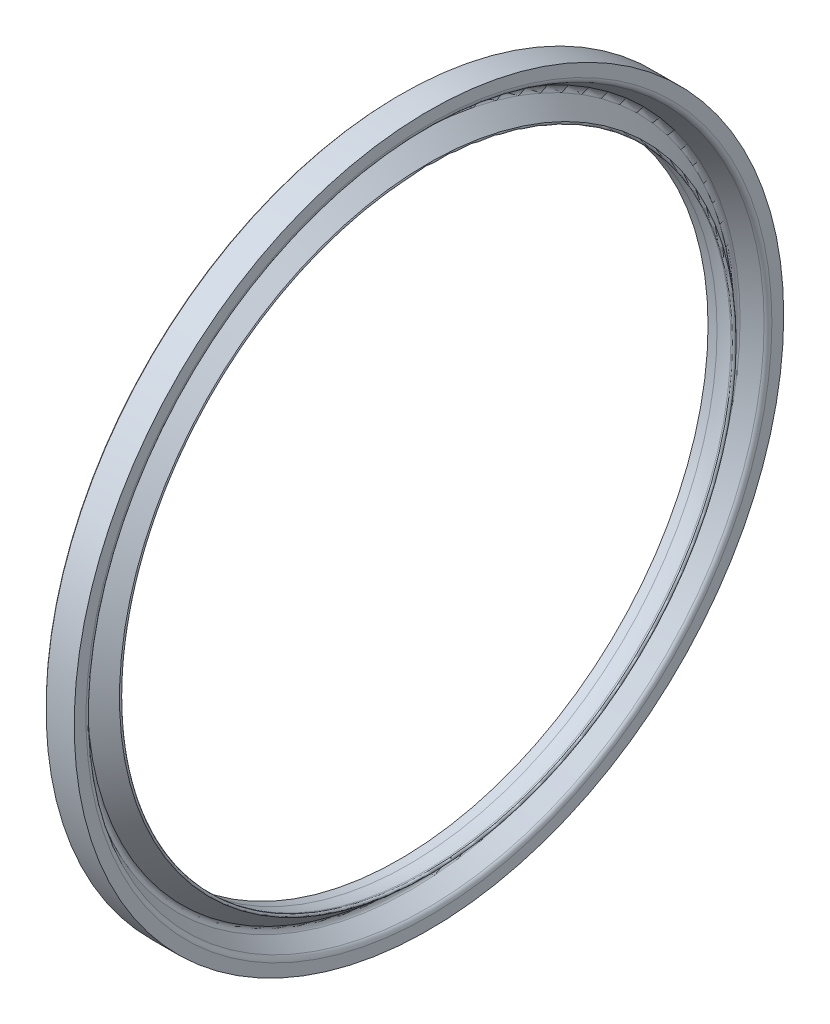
from build123d import *


with BuildPart() as part:
    # Esquisse1 → Base-R_volution (revolve)
    with BuildSketch(Plane(origin=(0, 0, 0), x_dir=(-1, 0, 0), z_dir=(0, 0, 1)), mode=Mode.PRIVATE) as base_r_volution_sk:
        with BuildLine():
            Line((4.6, 58), (4.8, 57.8))
            Line((4.8, 57.8), (4.8, 50.428718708))
            Line((4.8, 50.428718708), (3.329875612, 50.428718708))
            ThreePointArc((3.329875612, 50.428718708), (2.01137727, 50.342299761), (0.715438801, 50.084521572))
            Line((0.715438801, 50.084521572), (0.4, 50))
            ThreePointArc((0.4, 50), (0.12920448, 50.11915288), (0.186922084, 50.409318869))
            Line((0.186922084, 50.409318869), (3.04349708, 52.806269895))
            ThreePointArc((3.04349708, 52.806269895), (3.263139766, 53.336534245), (2.954754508, 53.820602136))
            Line((2.954754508, 53.820602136), (0.467146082, 55.256823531))
            ThreePointArc((0.467146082, 55.256823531), (0.125171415, 55.598798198), (0, 56.065944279))
            Line((0, 56.065944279), (0, 58))
            Line((0, 58), (4.6, 58))
        make_face()
    revolve(base_r_volution_sk.sketch.rotate(Axis((2.43404063, 0, 0), (-1, 0, 0)), 270), axis=Axis((2.43404063, 0, 0), (-1, 0, 0)))


solid = part.part
